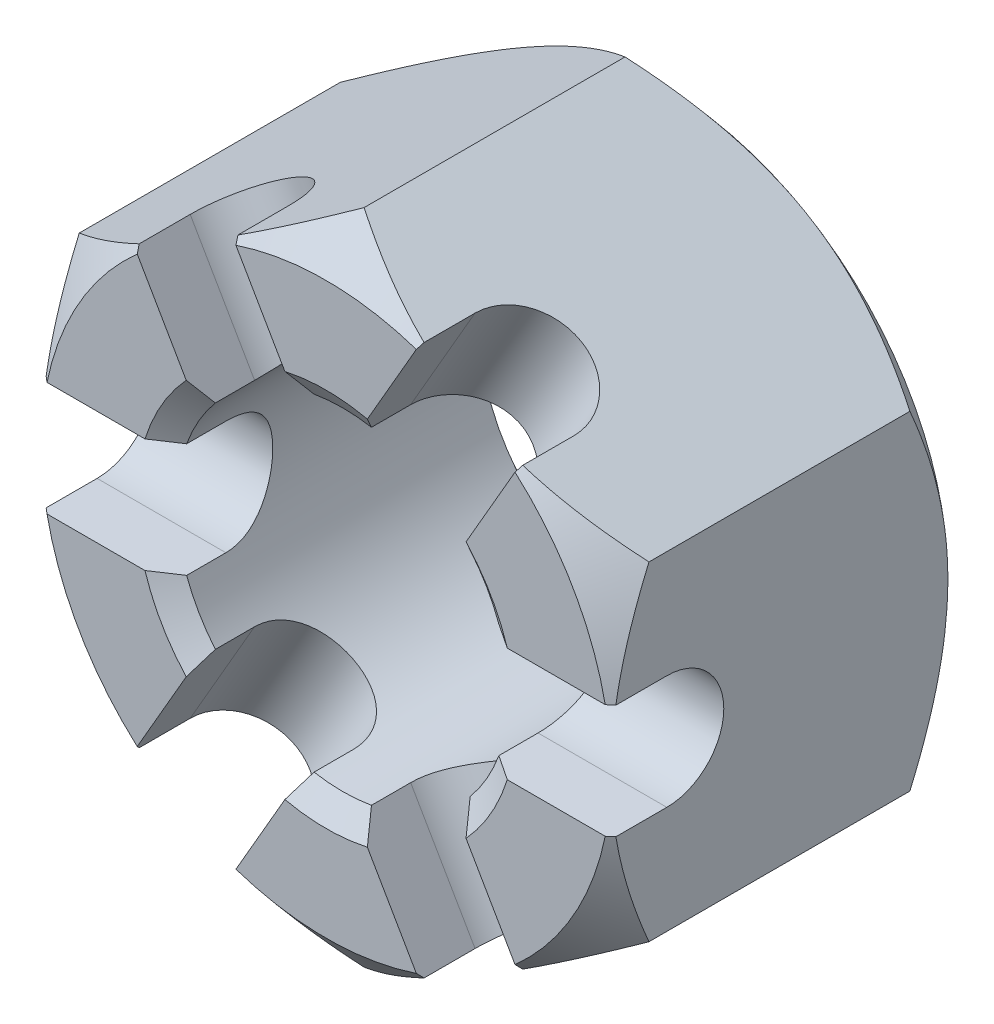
from build123d import *

# Parameters (mm, degrees)
BASENUT_START     = -22.5298
BASENUTSKE_R      = 11.1125
BASENUT_DEPTH     = 22.5298
SLOT_DEPTH        = 50.427440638
SLOTPATTERN_COUNT = 3
SLOTPATTERN_ANGLE = 120


with BuildPart() as part:
    # BaseNutSke → BaseNut (new body)
    with BuildSketch(Plane.XY.offset(BASENUT_START)):
        Polygon((19.05, 10.998522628), (19.05, -10.998522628), (0, -21.997045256), (-19.05, -10.998522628), (-19.05, 10.998522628), (0, 21.997045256), align=None)
        Circle(BASENUTSKE_R, mode=Mode.SUBTRACT)
    extrude(amount=BASENUT_DEPTH)

    # Sketch4 → Slot (cut, through all)
    with BuildSketch(Plane(origin=(19.05, 0, 0), x_dir=(0, 0, -1), z_dir=(1, 0, 0))):
        with BuildLine():
            Line((3.7338, 3.81), (0, 3.81))
            Line((0, 3.81), (0, -3.81))
            Line((0, -3.81), (3.7338, -3.81))
            ThreePointArc((3.7338, -3.81), (7.5438, 0), (3.7338, 3.81))
        make_face()
    slot = extrude(amount=-SLOT_DEPTH, mode=Mode.SUBTRACT)

    # SlotPattern: Slot ×3 about axis
    slotpattern_axis = Axis((0, 0, 0), (0, 0, 1))
    for i in range(1, SLOTPATTERN_COUNT):
        add(slot.rotate(slotpattern_axis, i * SLOTPATTERN_ANGLE / (SLOTPATTERN_COUNT - 1)), mode=Mode.SUBTRACT)

    # Sketch3 → Double-Chamfer (revolve, cut)
    with BuildSketch(Plane(origin=(0, 0, 0), x_dir=(0, 0, -1), z_dir=(1, 0, 0)), mode=Mode.PRIVATE) as double_chamfer_sk:
        Polygon((22.5298, 19.05), (19.9898, 21.997045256), (19.9898, 34.697045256), (35.2298, 34.697045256), (35.2298, 19.05), align=None)
        Polygon((2.54, 21.997045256), (2.54, 34.697045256), (-12.7, 34.697045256), (-12.7, 19.05), (0, 19.05), align=None)
    revolve(double_chamfer_sk.sketch.rotate(Axis((0, 0, 0), (0, 0, -1)), 90), axis=Axis((0, 0, 0), (0, 0, -1)), mode=Mode.SUBTRACT)

    # EndChamferSketch → EndChamfer (revolve, cut)
    with BuildSketch(Plane(origin=(0, 0, 0), x_dir=(0, 0, -1), z_dir=(1, 0, 0)), mode=Mode.PRIVATE) as endchamfer_sk:
        Polygon((22.5044, 12.7), (21.281662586, 10.95375), (22.5552, 10.95375), (22.5552, 12.7), align=None)
        Polygon((-0.0508, 12.7), (0, 12.7), (1.222737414, 10.95375), (-0.0508, 10.95375), align=None)
    revolve(endchamfer_sk.sketch.rotate(Axis((0, 0, -25.037505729), (0, 0, -1)), 270), axis=Axis((0, 0, -25.037505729), (0, 0, -1)), mode=Mode.SUBTRACT)


solid = part.part
